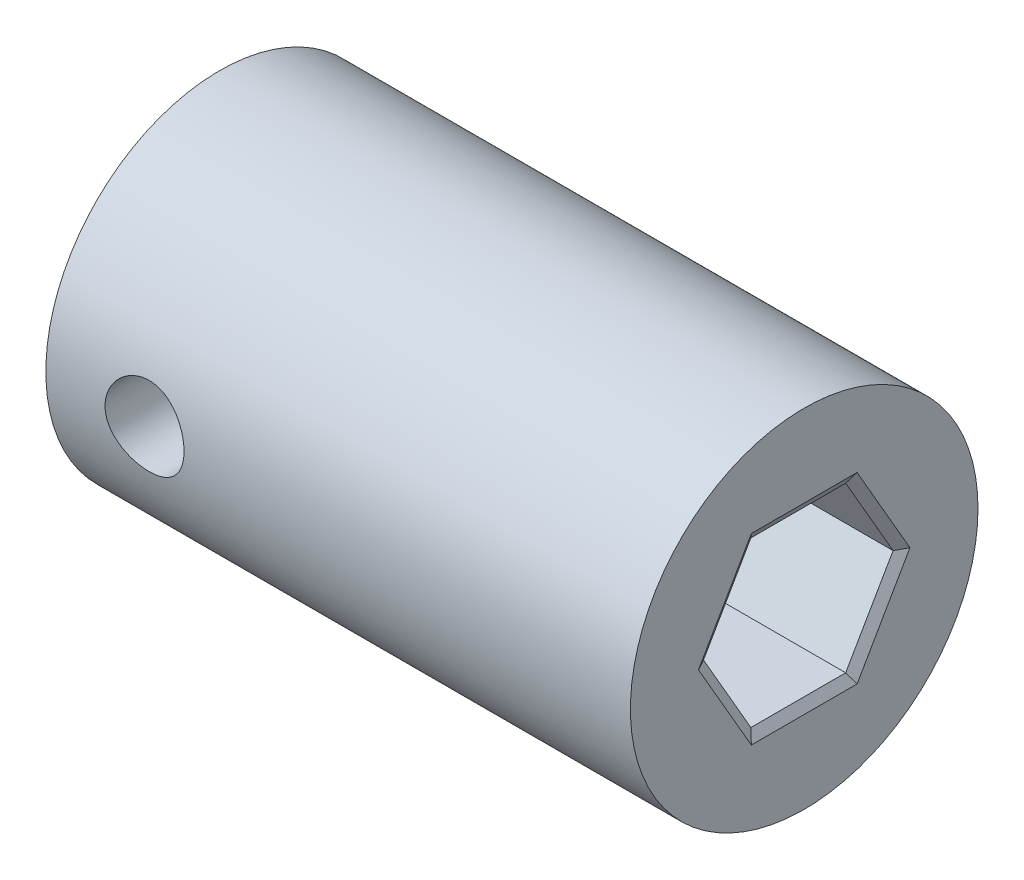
ISO-10303-21;
HEADER;
FILE_DESCRIPTION(('STEP AP214'),'2;1');
FILE_NAME('part.step','',(''),(''),'','','');
FILE_SCHEMA(('AUTOMOTIVE_DESIGN { 1 0 10303 214 1 1 1 1 }'));
ENDSEC;
DATA;
#1=APPLICATION_CONTEXT('core data for automotive mechanical design processes');
#2=APPLICATION_PROTOCOL_DEFINITION('international standard','automotive_design',2000,#1);
#3=PRODUCT_CONTEXT('',#1,'mechanical');
#4=PRODUCT('Part','Part','',(#3));
#5=PRODUCT_RELATED_PRODUCT_CATEGORY('part','',(#4));
#6=PRODUCT_DEFINITION_FORMATION('','',#4);
#7=PRODUCT_DEFINITION_CONTEXT('part definition',#1,'design');
#8=PRODUCT_DEFINITION('design','',#6,#7);
#9=PRODUCT_DEFINITION_SHAPE('','',#8);
#10=(LENGTH_UNIT() NAMED_UNIT(*) SI_UNIT(.MILLI.,.METRE.));
#11=(NAMED_UNIT(*) PLANE_ANGLE_UNIT() SI_UNIT($,.RADIAN.));
#12=(NAMED_UNIT(*) SI_UNIT($,.STERADIAN.) SOLID_ANGLE_UNIT());
#13=UNCERTAINTY_MEASURE_WITH_UNIT(LENGTH_MEASURE(1.E-05),#10,'distance_accuracy_value','');
#14=(GEOMETRIC_REPRESENTATION_CONTEXT(3) GLOBAL_UNCERTAINTY_ASSIGNED_CONTEXT((#13)) GLOBAL_UNIT_ASSIGNED_CONTEXT((#10,
#11,#12)) REPRESENTATION_CONTEXT('',''));
#15=CARTESIAN_POINT('',(0.,0.,0.));
#16=DIRECTION('',(0.,0.,1.));
#17=DIRECTION('',(1.,0.,0.));
#18=AXIS2_PLACEMENT_3D('',#15,#16,#17);
#19=CARTESIAN_POINT('',(37.,0.,0.));
#20=DIRECTION('',(1.,0.,0.));
#21=DIRECTION('',(0.,0.,-1.));
#22=AXIS2_PLACEMENT_3D('',#19,#20,#21);
#23=PLANE('',#22);
#24=DIRECTION('',(0.,0.866025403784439,0.5));
#25=VECTOR('',#24,1.);
#26=CARTESIAN_POINT('',(37.,-2.8980762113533,5.01961524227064));
#27=LINE('',#26,#25);
#28=CARTESIAN_POINT('',(37.,-5.79615242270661,3.34641016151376));
#29=VERTEX_POINT('',#28);
#30=CARTESIAN_POINT('',(37.,0.,6.69282032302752));
#31=VERTEX_POINT('',#30);
#32=EDGE_CURVE('E192',#29,#31,#27,.T.);
#33=ORIENTED_EDGE('',*,*,#32,.T.);
#34=DIRECTION('',(0.,0.866025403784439,-0.5));
#35=VECTOR('',#34,1.);
#36=CARTESIAN_POINT('',(37.,2.8980762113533,5.01961524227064));
#37=LINE('',#36,#35);
#38=CARTESIAN_POINT('',(37.,5.79615242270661,3.34641016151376));
#39=VERTEX_POINT('',#38);
#40=EDGE_CURVE('E194',#31,#39,#37,.T.);
#41=ORIENTED_EDGE('',*,*,#40,.T.);
#42=DIRECTION('',(0.,0.,-1.));
#43=VECTOR('',#42,1.);
#44=CARTESIAN_POINT('',(37.,5.79615242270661,0.));
#45=LINE('',#44,#43);
#46=CARTESIAN_POINT('',(37.,5.79615242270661,-3.34641016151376));
#47=VERTEX_POINT('',#46);
#48=EDGE_CURVE('E184',#39,#47,#45,.T.);
#49=ORIENTED_EDGE('',*,*,#48,.T.);
#50=DIRECTION('',(0.,-0.866025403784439,-0.5));
#51=VECTOR('',#50,1.);
#52=CARTESIAN_POINT('',(37.,2.8980762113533,-5.01961524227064));
#53=LINE('',#52,#51);
#54=CARTESIAN_POINT('',(37.,0.,-6.69282032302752));
#55=VERTEX_POINT('',#54);
#56=EDGE_CURVE('E186',#47,#55,#53,.T.);
#57=ORIENTED_EDGE('',*,*,#56,.T.);
#58=DIRECTION('',(0.,-0.866025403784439,0.5));
#59=VECTOR('',#58,1.);
#60=CARTESIAN_POINT('',(37.,-2.8980762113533,-5.01961524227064));
#61=LINE('',#60,#59);
#62=CARTESIAN_POINT('',(37.,-5.79615242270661,-3.34641016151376));
#63=VERTEX_POINT('',#62);
#64=EDGE_CURVE('E188',#55,#63,#61,.T.);
#65=ORIENTED_EDGE('',*,*,#64,.T.);
#66=DIRECTION('',(0.,0.,1.));
#67=VECTOR('',#66,1.);
#68=CARTESIAN_POINT('',(37.,-5.79615242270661,0.));
#69=LINE('',#68,#67);
#70=EDGE_CURVE('E190',#63,#29,#69,.T.);
#71=ORIENTED_EDGE('',*,*,#70,.T.);
#72=EDGE_LOOP('',(#33,#41,#49,#57,#65,#71));
#73=FACE_BOUND('',#72,.T.);
#74=CARTESIAN_POINT('',(37.,0.,0.));
#75=DIRECTION('',(1.,0.,0.));
#76=DIRECTION('',(0.,0.,-1.));
#77=AXIS2_PLACEMENT_3D('',#74,#75,#76);
#78=CIRCLE('',#77,11.);
#79=CARTESIAN_POINT('',(37.,0.,-11.));
#80=VERTEX_POINT('',#79);
#81=EDGE_CURVE('E167',#80,#80,#78,.T.);
#82=ORIENTED_EDGE('',*,*,#81,.T.);
#83=EDGE_LOOP('',(#82));
#84=FACE_BOUND('',#83,.T.);
#85=ADVANCED_FACE('F43',(#73,#84),#23,.T.);
#86=CARTESIAN_POINT('',(37.,0.,0.));
#87=DIRECTION('',(-1.,0.,0.));
#88=DIRECTION('',(0.,0.,1.));
#89=AXIS2_PLACEMENT_3D('',#86,#87,#88);
#90=CYLINDRICAL_SURFACE('',#89,3.9);
#91=CARTESIAN_POINT('',(8.74464655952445,0.,3.9));
#92=CARTESIAN_POINT('',(8.74463580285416,-0.126441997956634,3.89999010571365));
#93=CARTESIAN_POINT('',(8.7349890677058,-0.253016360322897,3.89378751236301));
#94=CARTESIAN_POINT('',(8.69693370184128,-0.502240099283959,3.86956150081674));
#95=CARTESIAN_POINT('',(8.6684942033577,-0.624882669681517,3.85151863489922));
#96=CARTESIAN_POINT('',(8.59454817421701,-0.862167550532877,3.80541821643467));
#97=CARTESIAN_POINT('',(8.54912653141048,-0.976846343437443,3.77741050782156));
#98=CARTESIAN_POINT('',(8.44310441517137,-1.19652682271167,3.71368080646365));
#99=CARTESIAN_POINT('',(8.3825047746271,-1.30152903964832,3.67795923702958));
#100=CARTESIAN_POINT('',(8.2423977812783,-1.50860126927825,3.59825154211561));
#101=CARTESIAN_POINT('',(8.16174836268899,-1.60972681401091,3.55382815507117));
#102=CARTESIAN_POINT('',(7.98649260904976,-1.79792643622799,3.46243148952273));
#103=CARTESIAN_POINT('',(7.89186692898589,-1.88498068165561,3.41545473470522));
#104=CARTESIAN_POINT('',(7.67544838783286,-2.05533987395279,3.31611586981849));
#105=CARTESIAN_POINT('',(7.55170560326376,-2.13630262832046,3.26395156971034));
#106=CARTESIAN_POINT('',(7.28934596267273,-2.27609269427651,3.16805958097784));
#107=CARTESIAN_POINT('',(7.15075517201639,-2.33495800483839,3.12431747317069));
#108=CARTESIAN_POINT('',(6.90063512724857,-2.41494132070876,3.06266033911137));
#109=CARTESIAN_POINT('',(6.79193474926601,-2.4419638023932,3.04095933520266));
#110=CARTESIAN_POINT('',(6.57032144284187,-2.48123999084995,3.00900466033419));
#111=CARTESIAN_POINT('',(6.45741522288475,-2.4935162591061,2.99873350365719));
#112=CARTESIAN_POINT('',(6.2301759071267,-2.50254999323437,2.99120155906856));
#113=CARTESIAN_POINT('',(6.11583945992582,-2.49925895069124,2.99398143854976));
#114=CARTESIAN_POINT('',(5.8896490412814,-2.47727931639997,3.01218762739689));
#115=CARTESIAN_POINT('',(5.77779720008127,-2.45857799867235,3.02762438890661));
#116=CARTESIAN_POINT('',(5.56285045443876,-2.40769612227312,3.0682249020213));
#117=CARTESIAN_POINT('',(5.45959292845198,-2.37594098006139,3.09307988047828));
#118=CARTESIAN_POINT('',(5.25970436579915,-2.30028771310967,3.14974682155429));
#119=CARTESIAN_POINT('',(5.16307554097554,-2.25638555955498,3.18156109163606));
#120=CARTESIAN_POINT('',(4.95926462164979,-2.14792495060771,3.25599897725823));
#121=CARTESIAN_POINT('',(4.85366566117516,-2.08101231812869,3.29952259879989));
#122=CARTESIAN_POINT('',(4.65399409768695,-1.93269700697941,3.38853672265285));
#123=CARTESIAN_POINT('',(4.55993540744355,-1.85127712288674,3.43402951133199));
#124=CARTESIAN_POINT('',(4.36837774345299,-1.65870029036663,3.53162798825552));
#125=CARTESIAN_POINT('',(4.27341600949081,-1.54482818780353,3.58341485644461));
#126=CARTESIAN_POINT('',(4.10400149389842,-1.29990010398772,3.67933400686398));
#127=CARTESIAN_POINT('',(4.02952688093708,-1.16886263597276,3.72347441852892));
#128=CARTESIAN_POINT('',(3.91686702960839,-0.919909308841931,3.79169883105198));
#129=CARTESIAN_POINT('',(3.87441510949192,-0.804538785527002,3.81802393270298));
#130=CARTESIAN_POINT('',(3.80668942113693,-0.567074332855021,3.86043147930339));
#131=CARTESIAN_POINT('',(3.78140181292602,-0.444985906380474,3.87652217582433));
#132=CARTESIAN_POINT('',(3.74927531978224,-0.196985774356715,3.8970145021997));
#133=CARTESIAN_POINT('',(3.74249893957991,-0.0710625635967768,3.90137652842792));
#134=CARTESIAN_POINT('',(3.74798547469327,0.180202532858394,3.89785987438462));
#135=CARTESIAN_POINT('',(3.76024942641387,0.305544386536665,3.88998052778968));
#136=CARTESIAN_POINT('',(3.80192612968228,0.545076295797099,3.86350165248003));
#137=CARTESIAN_POINT('',(3.83038123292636,0.659503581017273,3.84550139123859));
#138=CARTESIAN_POINT('',(3.90235760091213,0.881661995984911,3.80072700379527));
#139=CARTESIAN_POINT('',(3.94588139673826,0.989391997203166,3.77395140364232));
#140=CARTESIAN_POINT('',(4.05012648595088,1.20388427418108,3.71134103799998));
#141=CARTESIAN_POINT('',(4.1118795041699,1.30998901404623,3.67498372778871));
#142=CARTESIAN_POINT('',(4.24910176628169,1.5108337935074,3.59708329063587));
#143=CARTESIAN_POINT('',(4.32458156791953,1.60556499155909,3.55553617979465));
#144=CARTESIAN_POINT('',(4.50024746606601,1.79620589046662,3.46359320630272));
#145=CARTESIAN_POINT('',(4.60244662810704,1.89007990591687,3.41281584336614));
#146=CARTESIAN_POINT('',(4.82150923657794,2.06007294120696,3.31297723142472));
#147=CARTESIAN_POINT('',(4.93837581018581,2.13618816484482,3.26391635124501));
#148=CARTESIAN_POINT('',(5.16872118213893,2.25988927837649,3.1792675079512));
#149=CARTESIAN_POINT('',(5.28053349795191,2.30993770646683,3.14275488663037));
#150=CARTESIAN_POINT('',(5.51280286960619,2.39364931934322,3.07948498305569));
#151=CARTESIAN_POINT('',(5.63324770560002,2.42733516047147,3.05271422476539));
#152=CARTESIAN_POINT('',(5.81884703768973,2.46429517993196,3.02282850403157));
#153=CARTESIAN_POINT('',(5.88188967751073,2.47437069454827,3.01456203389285));
#154=CARTESIAN_POINT('',(6.00893400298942,2.48968352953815,3.00192910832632));
#155=CARTESIAN_POINT('',(6.07293517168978,2.49492336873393,2.99756062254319));
#156=CARTESIAN_POINT('',(6.20127642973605,2.50044848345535,2.9929535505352));
#157=CARTESIAN_POINT('',(6.26561637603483,2.5007357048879,2.99271334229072));
#158=CARTESIAN_POINT('',(6.39398994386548,2.49636279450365,2.99636059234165));
#159=CARTESIAN_POINT('',(6.45802359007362,2.49170306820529,3.00024771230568));
#160=CARTESIAN_POINT('',(6.63016363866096,2.47250323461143,3.01612313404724));
#161=CARTESIAN_POINT('',(6.73744683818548,2.45330859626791,3.03189462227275));
#162=CARTESIAN_POINT('',(6.94688268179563,2.40178029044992,3.07286678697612));
#163=CARTESIAN_POINT('',(7.04903008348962,2.36943349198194,3.09807688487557));
#164=CARTESIAN_POINT('',(7.28084212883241,2.2796094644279,3.16504234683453));
#165=CARTESIAN_POINT('',(7.40785967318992,2.21731346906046,3.20950553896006));
#166=CARTESIAN_POINT('',(7.64819507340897,2.07357628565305,3.30419272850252));
#167=CARTESIAN_POINT('',(7.76149408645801,1.99210920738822,3.35442446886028));
#168=CARTESIAN_POINT('',(7.97425542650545,1.8105903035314,3.45582357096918));
#169=CARTESIAN_POINT('',(8.07353603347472,1.71032783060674,3.50699493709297));
#170=CARTESIAN_POINT('',(8.25478469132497,1.49308707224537,3.60483555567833));
#171=CARTESIAN_POINT('',(8.33675228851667,1.37610834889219,3.65150469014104));
#172=CARTESIAN_POINT('',(8.4458090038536,1.1876055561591,3.71540339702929));
#173=CARTESIAN_POINT('',(8.48029101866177,1.12139245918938,3.73597050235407));
#174=CARTESIAN_POINT('',(8.54345201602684,0.985444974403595,3.77410513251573));
#175=CARTESIAN_POINT('',(8.57213430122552,0.915712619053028,3.79167436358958));
#176=CARTESIAN_POINT('',(8.62320999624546,0.77339434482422,3.82323979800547));
#177=CARTESIAN_POINT('',(8.64561838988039,0.700815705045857,3.83724450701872));
#178=CARTESIAN_POINT('',(8.68382929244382,0.553338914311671,3.86126808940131));
#179=CARTESIAN_POINT('',(8.69963639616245,0.478442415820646,3.87128973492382));
#180=CARTESIAN_POINT('',(8.72281466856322,0.336446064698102,3.88603234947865));
#181=CARTESIAN_POINT('',(8.73098796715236,0.269528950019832,3.89125596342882));
#182=CARTESIAN_POINT('',(8.74190684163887,0.135087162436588,3.89824246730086));
#183=CARTESIAN_POINT('',(8.74465230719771,0.0675624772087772,3.90000528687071));
#184=CARTESIAN_POINT('',(8.74464655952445,0.,3.9));
#185=B_SPLINE_CURVE_WITH_KNOTS('',3,(#91,#92,#93,#94,#95,#96,#97,#98,#99,#100,#101,#102,#103,
#104,#105,#106,#107,#108,#109,#110,#111,#112,#113,#114,#115,#116,#117,#118,#119,#120,#121,#122,
#123,#124,#125,#126,#127,#128,#129,#130,#131,#132,#133,#134,#135,#136,#137,#138,#139,#140,#141,
#142,#143,#144,#145,#146,#147,#148,#149,#150,#151,#152,#153,#154,#155,#156,#157,#158,#159,#160,
#161,#162,#163,#164,#165,#166,#167,#168,#169,#170,#171,#172,#173,#174,#175,#176,#177,#178,#179,
#180,#181,#182,#183,#184),.UNSPECIFIED.,.T.,.F.,(4,2,2,2,2,2,2,2,2,2,2,2,2,2,2,2,2,2,2,2,2,2,2,
2,2,2,2,2,2,2,2,2,2,2,2,2,2,2,2,2,2,2,2,2,2,2,4),(0.,0.379055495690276,0.758735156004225,
1.13654176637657,1.51432764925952,1.92305431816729,2.33235211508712,2.80054811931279,
3.26793528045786,3.60881330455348,3.94916912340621,4.29058620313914,4.63228551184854,
4.96363540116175,5.29509532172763,5.69078145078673,6.0869400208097,6.55581107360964,
7.02418053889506,7.39973772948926,7.77499173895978,8.15151126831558,8.52805129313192,
8.88434272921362,9.24069404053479,9.62333082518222,10.0062631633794,10.447762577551,
10.8893562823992,11.2714299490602,11.6529730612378,11.8458399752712,12.0386063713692,
12.2312970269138,12.4239718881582,12.752766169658,13.0818895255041,13.5244258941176,
13.9675633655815,14.4160014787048,14.864451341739,15.0964612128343,15.3283385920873,
15.5596573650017,15.7908148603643,15.9933536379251,16.1958965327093),.UNSPECIFIED.);
#186=CARTESIAN_POINT('',(8.74464655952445,0.,3.9));
#187=VERTEX_POINT('',#186);
#188=EDGE_CURVE('E145',#187,#187,#185,.T.);
#189=ORIENTED_EDGE('',*,*,#188,.F.);
#190=EDGE_LOOP('',(#189));
#191=FACE_BOUND('',#190,.T.);
#192=CARTESIAN_POINT('',(8.74464655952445,0.,-3.9));
#193=CARTESIAN_POINT('',(8.74463580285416,0.126441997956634,-3.89999010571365));
#194=CARTESIAN_POINT('',(8.7349890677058,0.253016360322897,-3.89378751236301));
#195=CARTESIAN_POINT('',(8.69693370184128,0.502240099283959,-3.86956150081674));
#196=CARTESIAN_POINT('',(8.6684942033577,0.624882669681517,-3.85151863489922));
#197=CARTESIAN_POINT('',(8.59454817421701,0.862167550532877,-3.80541821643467));
#198=CARTESIAN_POINT('',(8.54912653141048,0.976846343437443,-3.77741050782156));
#199=CARTESIAN_POINT('',(8.44310441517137,1.19652682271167,-3.71368080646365));
#200=CARTESIAN_POINT('',(8.3825047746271,1.30152903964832,-3.67795923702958));
#201=CARTESIAN_POINT('',(8.2423977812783,1.50860126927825,-3.59825154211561));
#202=CARTESIAN_POINT('',(8.16174836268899,1.60972681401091,-3.55382815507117));
#203=CARTESIAN_POINT('',(7.98649260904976,1.79792643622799,-3.46243148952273));
#204=CARTESIAN_POINT('',(7.89186692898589,1.88498068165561,-3.41545473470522));
#205=CARTESIAN_POINT('',(7.67544838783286,2.05533987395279,-3.31611586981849));
#206=CARTESIAN_POINT('',(7.55170560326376,2.13630262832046,-3.26395156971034));
#207=CARTESIAN_POINT('',(7.28934596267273,2.27609269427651,-3.16805958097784));
#208=CARTESIAN_POINT('',(7.15075517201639,2.33495800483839,-3.12431747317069));
#209=CARTESIAN_POINT('',(6.90063512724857,2.41494132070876,-3.06266033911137));
#210=CARTESIAN_POINT('',(6.79193474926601,2.4419638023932,-3.04095933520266));
#211=CARTESIAN_POINT('',(6.57032144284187,2.48123999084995,-3.00900466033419));
#212=CARTESIAN_POINT('',(6.45741522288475,2.4935162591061,-2.99873350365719));
#213=CARTESIAN_POINT('',(6.2301759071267,2.50254999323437,-2.99120155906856));
#214=CARTESIAN_POINT('',(6.11583945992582,2.49925895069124,-2.99398143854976));
#215=CARTESIAN_POINT('',(5.8896490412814,2.47727931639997,-3.01218762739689));
#216=CARTESIAN_POINT('',(5.77779720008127,2.45857799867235,-3.02762438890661));
#217=CARTESIAN_POINT('',(5.56285045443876,2.40769612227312,-3.0682249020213));
#218=CARTESIAN_POINT('',(5.45959292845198,2.37594098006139,-3.09307988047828));
#219=CARTESIAN_POINT('',(5.25970436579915,2.30028771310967,-3.14974682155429));
#220=CARTESIAN_POINT('',(5.16307554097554,2.25638555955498,-3.18156109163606));
#221=CARTESIAN_POINT('',(4.95926462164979,2.14792495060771,-3.25599897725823));
#222=CARTESIAN_POINT('',(4.85366566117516,2.08101231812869,-3.29952259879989));
#223=CARTESIAN_POINT('',(4.65399409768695,1.93269700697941,-3.38853672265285));
#224=CARTESIAN_POINT('',(4.55993540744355,1.85127712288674,-3.43402951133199));
#225=CARTESIAN_POINT('',(4.36837774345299,1.65870029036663,-3.53162798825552));
#226=CARTESIAN_POINT('',(4.27341600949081,1.54482818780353,-3.58341485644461));
#227=CARTESIAN_POINT('',(4.10400149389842,1.29990010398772,-3.67933400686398));
#228=CARTESIAN_POINT('',(4.02952688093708,1.16886263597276,-3.72347441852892));
#229=CARTESIAN_POINT('',(3.91686702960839,0.919909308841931,-3.79169883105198));
#230=CARTESIAN_POINT('',(3.87441510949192,0.804538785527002,-3.81802393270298));
#231=CARTESIAN_POINT('',(3.80668942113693,0.567074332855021,-3.86043147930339));
#232=CARTESIAN_POINT('',(3.78140181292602,0.444985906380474,-3.87652217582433));
#233=CARTESIAN_POINT('',(3.74927531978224,0.196985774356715,-3.8970145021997));
#234=CARTESIAN_POINT('',(3.74249893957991,0.0710625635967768,-3.90137652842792));
#235=CARTESIAN_POINT('',(3.74798547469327,-0.180202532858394,-3.89785987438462));
#236=CARTESIAN_POINT('',(3.76024942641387,-0.305544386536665,-3.88998052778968));
#237=CARTESIAN_POINT('',(3.80192612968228,-0.545076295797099,-3.86350165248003));
#238=CARTESIAN_POINT('',(3.83038123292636,-0.659503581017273,-3.84550139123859));
#239=CARTESIAN_POINT('',(3.90235760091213,-0.881661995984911,-3.80072700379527));
#240=CARTESIAN_POINT('',(3.94588139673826,-0.989391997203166,-3.77395140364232));
#241=CARTESIAN_POINT('',(4.05012648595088,-1.20388427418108,-3.71134103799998));
#242=CARTESIAN_POINT('',(4.1118795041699,-1.30998901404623,-3.67498372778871));
#243=CARTESIAN_POINT('',(4.24910176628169,-1.5108337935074,-3.59708329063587));
#244=CARTESIAN_POINT('',(4.32458156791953,-1.60556499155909,-3.55553617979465));
#245=CARTESIAN_POINT('',(4.50024746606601,-1.79620589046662,-3.46359320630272));
#246=CARTESIAN_POINT('',(4.60244662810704,-1.89007990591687,-3.41281584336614));
#247=CARTESIAN_POINT('',(4.82150923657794,-2.06007294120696,-3.31297723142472));
#248=CARTESIAN_POINT('',(4.93837581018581,-2.13618816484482,-3.26391635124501));
#249=CARTESIAN_POINT('',(5.16872118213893,-2.25988927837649,-3.1792675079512));
#250=CARTESIAN_POINT('',(5.28053349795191,-2.30993770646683,-3.14275488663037));
#251=CARTESIAN_POINT('',(5.51280286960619,-2.39364931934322,-3.07948498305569));
#252=CARTESIAN_POINT('',(5.63324770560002,-2.42733516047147,-3.05271422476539));
#253=CARTESIAN_POINT('',(5.81884703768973,-2.46429517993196,-3.02282850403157));
#254=CARTESIAN_POINT('',(5.88188967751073,-2.47437069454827,-3.01456203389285));
#255=CARTESIAN_POINT('',(6.00893400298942,-2.48968352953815,-3.00192910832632));
#256=CARTESIAN_POINT('',(6.07293517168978,-2.49492336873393,-2.99756062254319));
#257=CARTESIAN_POINT('',(6.20127642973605,-2.50044848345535,-2.9929535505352));
#258=CARTESIAN_POINT('',(6.26561637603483,-2.5007357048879,-2.99271334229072));
#259=CARTESIAN_POINT('',(6.39398994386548,-2.49636279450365,-2.99636059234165));
#260=CARTESIAN_POINT('',(6.45802359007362,-2.49170306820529,-3.00024771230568));
#261=CARTESIAN_POINT('',(6.63016363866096,-2.47250323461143,-3.01612313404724));
#262=CARTESIAN_POINT('',(6.73744683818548,-2.45330859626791,-3.03189462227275));
#263=CARTESIAN_POINT('',(6.94688268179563,-2.40178029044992,-3.07286678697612));
#264=CARTESIAN_POINT('',(7.04903008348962,-2.36943349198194,-3.09807688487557));
#265=CARTESIAN_POINT('',(7.28084212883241,-2.2796094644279,-3.16504234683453));
#266=CARTESIAN_POINT('',(7.40785967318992,-2.21731346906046,-3.20950553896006));
#267=CARTESIAN_POINT('',(7.64819507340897,-2.07357628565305,-3.30419272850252));
#268=CARTESIAN_POINT('',(7.76149408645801,-1.99210920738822,-3.35442446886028));
#269=CARTESIAN_POINT('',(7.97425542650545,-1.8105903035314,-3.45582357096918));
#270=CARTESIAN_POINT('',(8.07353603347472,-1.71032783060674,-3.50699493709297));
#271=CARTESIAN_POINT('',(8.25478469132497,-1.49308707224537,-3.60483555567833));
#272=CARTESIAN_POINT('',(8.33675228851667,-1.37610834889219,-3.65150469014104));
#273=CARTESIAN_POINT('',(8.4458090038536,-1.1876055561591,-3.71540339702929));
#274=CARTESIAN_POINT('',(8.48029101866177,-1.12139245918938,-3.73597050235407));
#275=CARTESIAN_POINT('',(8.54345201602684,-0.985444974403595,-3.77410513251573));
#276=CARTESIAN_POINT('',(8.57213430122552,-0.915712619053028,-3.79167436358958));
#277=CARTESIAN_POINT('',(8.62320999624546,-0.77339434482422,-3.82323979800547));
#278=CARTESIAN_POINT('',(8.64561838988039,-0.700815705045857,-3.83724450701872));
#279=CARTESIAN_POINT('',(8.68382929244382,-0.553338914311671,-3.86126808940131));
#280=CARTESIAN_POINT('',(8.69963639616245,-0.478442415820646,-3.87128973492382));
#281=CARTESIAN_POINT('',(8.72281466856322,-0.336446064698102,-3.88603234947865));
#282=CARTESIAN_POINT('',(8.73098796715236,-0.269528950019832,-3.89125596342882));
#283=CARTESIAN_POINT('',(8.74190684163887,-0.135087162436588,-3.89824246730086));
#284=CARTESIAN_POINT('',(8.74465230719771,-0.0675624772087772,-3.90000528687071));
#285=CARTESIAN_POINT('',(8.74464655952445,0.,-3.9));
#286=B_SPLINE_CURVE_WITH_KNOTS('',3,(#192,#193,#194,#195,#196,#197,#198,#199,#200,#201,#202,
#203,#204,#205,#206,#207,#208,#209,#210,#211,#212,#213,#214,#215,#216,#217,#218,#219,#220,#221,
#222,#223,#224,#225,#226,#227,#228,#229,#230,#231,#232,#233,#234,#235,#236,#237,#238,#239,#240,
#241,#242,#243,#244,#245,#246,#247,#248,#249,#250,#251,#252,#253,#254,#255,#256,#257,#258,#259,
#260,#261,#262,#263,#264,#265,#266,#267,#268,#269,#270,#271,#272,#273,#274,#275,#276,#277,#278,
#279,#280,#281,#282,#283,#284,#285),.UNSPECIFIED.,.T.,.F.,(4,2,2,2,2,2,2,2,2,2,2,2,2,2,2,2,2,2,
2,2,2,2,2,2,2,2,2,2,2,2,2,2,2,2,2,2,2,2,2,2,2,2,2,2,2,2,4),(0.,0.379055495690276,
0.758735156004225,1.13654176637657,1.51432764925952,1.92305431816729,2.33235211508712,
2.80054811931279,3.26793528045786,3.60881330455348,3.94916912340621,4.29058620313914,
4.63228551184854,4.96363540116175,5.29509532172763,5.69078145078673,6.0869400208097,
6.55581107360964,7.02418053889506,7.39973772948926,7.77499173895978,8.15151126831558,
8.52805129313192,8.88434272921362,9.24069404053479,9.62333082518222,10.0062631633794,
10.447762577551,10.8893562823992,11.2714299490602,11.6529730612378,11.8458399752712,
12.0386063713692,12.2312970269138,12.4239718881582,12.752766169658,13.0818895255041,
13.5244258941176,13.9675633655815,14.4160014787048,14.864451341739,15.0964612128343,
15.3283385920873,15.5596573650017,15.7908148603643,15.9933536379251,16.1958965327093),.UNSPECIFIED.);
#287=CARTESIAN_POINT('',(8.74464655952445,0.,-3.9));
#288=VERTEX_POINT('',#287);
#289=EDGE_CURVE('E233',#288,#288,#286,.T.);
#290=ORIENTED_EDGE('',*,*,#289,.F.);
#291=EDGE_LOOP('',(#290));
#292=FACE_BOUND('',#291,.T.);
#293=CARTESIAN_POINT('',(1.2,0.,0.));
#294=DIRECTION('',(1.,0.,0.));
#295=DIRECTION('',(0.,0.,-1.));
#296=AXIS2_PLACEMENT_3D('',#293,#294,#295);
#297=CIRCLE('',#296,3.9);
#298=CARTESIAN_POINT('',(1.2,0.,-3.9));
#299=VERTEX_POINT('',#298);
#300=EDGE_CURVE('E176',#299,#299,#297,.F.);
#301=ORIENTED_EDGE('',*,*,#300,.T.);
#302=EDGE_LOOP('',(#301));
#303=FACE_BOUND('',#302,.T.);
#304=CARTESIAN_POINT('',(20.,0.,0.));
#305=DIRECTION('',(1.,0.,0.));
#306=DIRECTION('',(0.,0.,-1.));
#307=AXIS2_PLACEMENT_3D('',#304,#305,#306);
#308=CIRCLE('',#307,3.9);
#309=CARTESIAN_POINT('',(20.,0.,-3.9));
#310=VERTEX_POINT('',#309);
#311=EDGE_CURVE('E123',#310,#310,#308,.T.);
#312=ORIENTED_EDGE('',*,*,#311,.T.);
#313=EDGE_LOOP('',(#312));
#314=FACE_BOUND('',#313,.T.);
#315=ADVANCED_FACE('F237',(#191,#292,#303,#314),#90,.F.);
#316=CARTESIAN_POINT('',(0.,0.,0.));
#317=DIRECTION('',(1.,0.,0.));
#318=DIRECTION('',(0.,0.,-1.));
#319=AXIS2_PLACEMENT_3D('',#316,#317,#318);
#320=PLANE('',#319);
#321=CARTESIAN_POINT('',(0.,0.,0.));
#322=DIRECTION('',(1.,0.,0.));
#323=DIRECTION('',(0.,0.,-1.));
#324=AXIS2_PLACEMENT_3D('',#321,#322,#323);
#325=CIRCLE('',#324,4.64984322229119);
#326=CARTESIAN_POINT('',(0.,0.,-4.64984322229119));
#327=VERTEX_POINT('',#326);
#328=EDGE_CURVE('E170',#327,#327,#325,.T.);
#329=ORIENTED_EDGE('',*,*,#328,.T.);
#330=EDGE_LOOP('',(#329));
#331=FACE_BOUND('',#330,.T.);
#332=CARTESIAN_POINT('',(0.,0.,0.));
#333=DIRECTION('',(1.,0.,0.));
#334=DIRECTION('',(0.,0.,-1.));
#335=AXIS2_PLACEMENT_3D('',#332,#333,#334);
#336=CIRCLE('',#335,11.);
#337=CARTESIAN_POINT('',(0.,0.,-11.));
#338=VERTEX_POINT('',#337);
#339=EDGE_CURVE('E171',#338,#338,#336,.T.);
#340=ORIENTED_EDGE('',*,*,#339,.F.);
#341=EDGE_LOOP('',(#340));
#342=FACE_BOUND('',#341,.T.);
#343=ADVANCED_FACE('F242',(#331,#342),#320,.F.);
#344=CARTESIAN_POINT('',(37.,0.,0.));
#345=DIRECTION('',(-1.,0.,0.));
#346=DIRECTION('',(0.,0.,1.));
#347=AXIS2_PLACEMENT_3D('',#344,#345,#346);
#348=CYLINDRICAL_SURFACE('',#347,11.);
#349=CARTESIAN_POINT('',(8.74464655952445,0.,-11.));
#350=CARTESIAN_POINT('',(8.74464202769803,0.138518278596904,-10.9999974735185));
#351=CARTESIAN_POINT('',(8.73309533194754,0.277090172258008,-10.9973570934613));
#352=CARTESIAN_POINT('',(8.68726708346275,0.550288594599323,-10.987079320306));
#353=CARTESIAN_POINT('',(8.65297016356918,0.684912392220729,-10.9794385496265));
#354=CARTESIAN_POINT('',(8.56277851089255,0.946227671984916,-10.9600095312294));
#355=CARTESIAN_POINT('',(8.50690723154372,1.07292759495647,-10.9482257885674));
#356=CARTESIAN_POINT('',(8.37522944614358,1.31515227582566,-10.921778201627));
#357=CARTESIAN_POINT('',(8.29942313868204,1.43067714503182,-10.9071143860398));
#358=CARTESIAN_POINT('',(8.12864451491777,1.64926760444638,-10.8762265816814));
#359=CARTESIAN_POINT('',(8.03339398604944,1.75211293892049,-10.8599819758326));
#360=CARTESIAN_POINT('',(7.8270275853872,1.9405138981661,-10.827906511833));
#361=CARTESIAN_POINT('',(7.71591020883,2.02606788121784,-10.8120756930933));
#362=CARTESIAN_POINT('',(7.47931450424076,2.17844599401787,-10.7824158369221));
#363=CARTESIAN_POINT('',(7.35367956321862,2.24503254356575,-10.7686131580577));
#364=CARTESIAN_POINT('',(7.09263705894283,2.3560606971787,-10.7448696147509));
#365=CARTESIAN_POINT('',(6.95723076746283,2.40050517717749,-10.7349282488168));
#366=CARTESIAN_POINT('',(6.68288737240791,2.46525349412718,-10.7202434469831));
#367=CARTESIAN_POINT('',(6.5440472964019,2.48594892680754,-10.715415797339));
#368=CARTESIAN_POINT('',(6.26478833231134,2.50382988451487,-10.7112523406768));
#369=CARTESIAN_POINT('',(6.12436965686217,2.50101853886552,-10.711915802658));
#370=CARTESIAN_POINT('',(5.84887367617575,2.47228016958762,-10.7185835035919));
#371=CARTESIAN_POINT('',(5.71374565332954,2.44681104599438,-10.7244819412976));
#372=CARTESIAN_POINT('',(5.44973207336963,2.37420684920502,-10.7407873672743));
#373=CARTESIAN_POINT('',(5.32084689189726,2.32707047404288,-10.7511946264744));
#374=CARTESIAN_POINT('',(5.07170588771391,2.21205734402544,-10.7754474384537));
#375=CARTESIAN_POINT('',(4.95153304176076,2.14400712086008,-10.7893215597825));
#376=CARTESIAN_POINT('',(4.72414400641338,1.98921977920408,-10.8189276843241));
#377=CARTESIAN_POINT('',(4.61692971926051,1.90247992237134,-10.8346599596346));
#378=CARTESIAN_POINT('',(4.41586799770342,1.71036518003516,-10.8666615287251));
#379=CARTESIAN_POINT('',(4.32239213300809,1.60460166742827,-10.882934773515));
#380=CARTESIAN_POINT('',(4.15444067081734,1.37871229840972,-10.9138502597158));
#381=CARTESIAN_POINT('',(4.07996547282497,1.2585861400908,-10.9284924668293));
#382=CARTESIAN_POINT('',(3.95202617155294,1.00690799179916,-10.9545497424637));
#383=CARTESIAN_POINT('',(3.89861378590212,0.875328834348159,-10.9659568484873));
#384=CARTESIAN_POINT('',(3.81476255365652,0.604745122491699,-10.9841998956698));
#385=CARTESIAN_POINT('',(3.78432009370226,0.465741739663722,-10.9910365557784));
#386=CARTESIAN_POINT('',(3.74782032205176,0.187439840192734,-10.9992650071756));
#387=CARTESIAN_POINT('',(3.74125586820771,0.0482110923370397,-11.0007700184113));
#388=CARTESIAN_POINT('',(3.75131959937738,-0.229353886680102,-10.9984842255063));
#389=CARTESIAN_POINT('',(3.76794607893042,-0.367690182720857,-10.9946938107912));
#390=CARTESIAN_POINT('',(3.82349972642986,-0.637841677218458,-10.9823148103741));
#391=CARTESIAN_POINT('',(3.86215810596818,-0.769715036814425,-10.973784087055));
#392=CARTESIAN_POINT('',(3.96037758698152,-1.0251039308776,-10.9528806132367));
#393=CARTESIAN_POINT('',(4.01994056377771,-1.14861871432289,-10.9405075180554));
#394=CARTESIAN_POINT('',(4.15931570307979,-1.38586085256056,-10.9130143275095));
#395=CARTESIAN_POINT('',(4.23942218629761,-1.49941068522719,-10.8978552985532));
#396=CARTESIAN_POINT('',(4.41722588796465,-1.71163773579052,-10.866546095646));
#397=CARTESIAN_POINT('',(4.51492558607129,-1.8103128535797,-10.8503957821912));
#398=CARTESIAN_POINT('',(4.72747752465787,-1.99201706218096,-10.8185287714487));
#399=CARTESIAN_POINT('',(4.84263380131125,-2.07469366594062,-10.8028272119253));
#400=CARTESIAN_POINT('',(5.08549295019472,-2.21953814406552,-10.7740023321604));
#401=CARTESIAN_POINT('',(5.21319526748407,-2.28170692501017,-10.7608788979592));
#402=CARTESIAN_POINT('',(5.47682702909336,-2.38333597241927,-10.7388274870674));
#403=CARTESIAN_POINT('',(5.61270388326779,-2.42292716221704,-10.7298753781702));
#404=CARTESIAN_POINT('',(5.88941346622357,-2.47865258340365,-10.7171411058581));
#405=CARTESIAN_POINT('',(6.03024532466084,-2.49479091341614,-10.7133580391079));
#406=CARTESIAN_POINT('',(6.30930517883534,-2.50296739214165,-10.7114502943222));
#407=CARTESIAN_POINT('',(6.44751615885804,-2.4955654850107,-10.7131941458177));
#408=CARTESIAN_POINT('',(6.7206654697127,-2.45813115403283,-10.7218446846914));
#409=CARTESIAN_POINT('',(6.85560384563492,-2.42809904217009,-10.7287513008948));
#410=CARTESIAN_POINT('',(7.11788995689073,-2.34653692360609,-10.7468826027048));
#411=CARTESIAN_POINT('',(7.24526625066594,-2.29509457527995,-10.758089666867));
#412=CARTESIAN_POINT('',(7.48966126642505,-2.1722453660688,-10.783564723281));
#413=CARTESIAN_POINT('',(7.60667880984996,-2.10083623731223,-10.7978330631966));
#414=CARTESIAN_POINT('',(7.82978098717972,-1.93824996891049,-10.828211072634));
#415=CARTESIAN_POINT('',(7.93557228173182,-1.84667645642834,-10.8443540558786));
#416=CARTESIAN_POINT('',(8.1304697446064,-1.64715628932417,-10.8764454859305));
#417=CARTESIAN_POINT('',(8.21957203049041,-1.53920583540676,-10.8923938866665));
#418=CARTESIAN_POINT('',(8.37978461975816,-1.30814060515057,-10.9225693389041));
#419=CARTESIAN_POINT('',(8.45062038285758,-1.1848316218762,-10.9367686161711));
#420=CARTESIAN_POINT('',(8.5704465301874,-0.92775596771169,-10.9615640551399));
#421=CARTESIAN_POINT('',(8.61945455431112,-0.793997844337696,-10.9721631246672));
#422=CARTESIAN_POINT('',(8.68587446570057,-0.550163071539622,-10.9867559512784));
#423=CARTESIAN_POINT('',(8.70787054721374,-0.441368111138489,-10.9916908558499));
#424=CARTESIAN_POINT('',(8.73725803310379,-0.221726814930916,-10.9983138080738));
#425=CARTESIAN_POINT('',(8.74465018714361,-0.110880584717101,-11.0000020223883));
#426=CARTESIAN_POINT('',(8.74464655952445,0.,-11.));
#427=B_SPLINE_CURVE_WITH_KNOTS('',3,(#349,#350,#351,#352,#353,#354,#355,#356,#357,#358,#359,
#360,#361,#362,#363,#364,#365,#366,#367,#368,#369,#370,#371,#372,#373,#374,#375,#376,#377,#378,
#379,#380,#381,#382,#383,#384,#385,#386,#387,#388,#389,#390,#391,#392,#393,#394,#395,#396,#397,
#398,#399,#400,#401,#402,#403,#404,#405,#406,#407,#408,#409,#410,#411,#412,#413,#414,#415,#416,
#417,#418,#419,#420,#421,#422,#423,#424,#425,#426),.UNSPECIFIED.,.T.,.F.,(4,2,2,2,2,2,2,2,2,2,2,
2,2,2,2,2,2,2,2,2,2,2,2,2,2,2,2,2,2,2,2,2,2,2,2,2,2,2,4),(0.,0.415148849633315,
0.830578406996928,1.24555761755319,1.66053269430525,2.08192389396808,2.50335508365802,
2.92985362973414,3.35629676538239,3.77560244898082,4.19485231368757,4.60581714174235,
5.01680666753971,5.4313015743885,5.84585725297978,6.27011531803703,6.69438230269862,
7.11968464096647,7.54492006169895,7.96106941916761,8.37718817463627,8.78833576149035,
9.19952024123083,9.61696129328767,10.0344612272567,10.4603132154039,10.8861463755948,
11.3094844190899,11.732748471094,12.1460204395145,12.5592867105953,12.9708773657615,
13.382514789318,13.8031102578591,14.2238034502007,14.6504927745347,15.0768366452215,
15.4091704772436,15.74148724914),.UNSPECIFIED.);
#428=CARTESIAN_POINT('',(8.74464655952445,0.,-11.));
#429=VERTEX_POINT('',#428);
#430=EDGE_CURVE('E12',#429,#429,#427,.T.);
#431=ORIENTED_EDGE('',*,*,#430,.T.);
#432=EDGE_LOOP('',(#431));
#433=FACE_BOUND('',#432,.T.);
#434=CARTESIAN_POINT('',(8.74464655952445,0.,11.));
#435=CARTESIAN_POINT('',(8.74464202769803,-0.138518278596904,10.9999974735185));
#436=CARTESIAN_POINT('',(8.73309533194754,-0.277090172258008,10.9973570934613));
#437=CARTESIAN_POINT('',(8.68726708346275,-0.550288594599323,10.987079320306));
#438=CARTESIAN_POINT('',(8.65297016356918,-0.684912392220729,10.9794385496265));
#439=CARTESIAN_POINT('',(8.56277851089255,-0.946227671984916,10.9600095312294));
#440=CARTESIAN_POINT('',(8.50690723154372,-1.07292759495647,10.9482257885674));
#441=CARTESIAN_POINT('',(8.37522944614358,-1.31515227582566,10.921778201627));
#442=CARTESIAN_POINT('',(8.29942313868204,-1.43067714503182,10.9071143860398));
#443=CARTESIAN_POINT('',(8.12864451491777,-1.64926760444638,10.8762265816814));
#444=CARTESIAN_POINT('',(8.03339398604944,-1.75211293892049,10.8599819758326));
#445=CARTESIAN_POINT('',(7.8270275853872,-1.9405138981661,10.827906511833));
#446=CARTESIAN_POINT('',(7.71591020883,-2.02606788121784,10.8120756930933));
#447=CARTESIAN_POINT('',(7.47931450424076,-2.17844599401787,10.7824158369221));
#448=CARTESIAN_POINT('',(7.35367956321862,-2.24503254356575,10.7686131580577));
#449=CARTESIAN_POINT('',(7.09263705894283,-2.3560606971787,10.7448696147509));
#450=CARTESIAN_POINT('',(6.95723076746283,-2.40050517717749,10.7349282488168));
#451=CARTESIAN_POINT('',(6.68288737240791,-2.46525349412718,10.7202434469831));
#452=CARTESIAN_POINT('',(6.5440472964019,-2.48594892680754,10.715415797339));
#453=CARTESIAN_POINT('',(6.26478833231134,-2.50382988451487,10.7112523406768));
#454=CARTESIAN_POINT('',(6.12436965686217,-2.50101853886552,10.711915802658));
#455=CARTESIAN_POINT('',(5.84887367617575,-2.47228016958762,10.7185835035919));
#456=CARTESIAN_POINT('',(5.71374565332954,-2.44681104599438,10.7244819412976));
#457=CARTESIAN_POINT('',(5.44973207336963,-2.37420684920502,10.7407873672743));
#458=CARTESIAN_POINT('',(5.32084689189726,-2.32707047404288,10.7511946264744));
#459=CARTESIAN_POINT('',(5.07170588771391,-2.21205734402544,10.7754474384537));
#460=CARTESIAN_POINT('',(4.95153304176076,-2.14400712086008,10.7893215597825));
#461=CARTESIAN_POINT('',(4.72414400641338,-1.98921977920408,10.8189276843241));
#462=CARTESIAN_POINT('',(4.61692971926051,-1.90247992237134,10.8346599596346));
#463=CARTESIAN_POINT('',(4.41586799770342,-1.71036518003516,10.8666615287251));
#464=CARTESIAN_POINT('',(4.32239213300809,-1.60460166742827,10.882934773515));
#465=CARTESIAN_POINT('',(4.15444067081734,-1.37871229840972,10.9138502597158));
#466=CARTESIAN_POINT('',(4.07996547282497,-1.2585861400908,10.9284924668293));
#467=CARTESIAN_POINT('',(3.95202617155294,-1.00690799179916,10.9545497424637));
#468=CARTESIAN_POINT('',(3.89861378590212,-0.875328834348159,10.9659568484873));
#469=CARTESIAN_POINT('',(3.81476255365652,-0.604745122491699,10.9841998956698));
#470=CARTESIAN_POINT('',(3.78432009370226,-0.465741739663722,10.9910365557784));
#471=CARTESIAN_POINT('',(3.74782032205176,-0.187439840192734,10.9992650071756));
#472=CARTESIAN_POINT('',(3.74125586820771,-0.0482110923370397,11.0007700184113));
#473=CARTESIAN_POINT('',(3.75131959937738,0.229353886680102,10.9984842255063));
#474=CARTESIAN_POINT('',(3.76794607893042,0.367690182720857,10.9946938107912));
#475=CARTESIAN_POINT('',(3.82349972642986,0.637841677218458,10.9823148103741));
#476=CARTESIAN_POINT('',(3.86215810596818,0.769715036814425,10.973784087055));
#477=CARTESIAN_POINT('',(3.96037758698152,1.0251039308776,10.9528806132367));
#478=CARTESIAN_POINT('',(4.01994056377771,1.14861871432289,10.9405075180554));
#479=CARTESIAN_POINT('',(4.15931570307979,1.38586085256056,10.9130143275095));
#480=CARTESIAN_POINT('',(4.23942218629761,1.49941068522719,10.8978552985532));
#481=CARTESIAN_POINT('',(4.41722588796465,1.71163773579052,10.866546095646));
#482=CARTESIAN_POINT('',(4.51492558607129,1.8103128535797,10.8503957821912));
#483=CARTESIAN_POINT('',(4.72747752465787,1.99201706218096,10.8185287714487));
#484=CARTESIAN_POINT('',(4.84263380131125,2.07469366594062,10.8028272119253));
#485=CARTESIAN_POINT('',(5.08549295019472,2.21953814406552,10.7740023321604));
#486=CARTESIAN_POINT('',(5.21319526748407,2.28170692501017,10.7608788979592));
#487=CARTESIAN_POINT('',(5.47682702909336,2.38333597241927,10.7388274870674));
#488=CARTESIAN_POINT('',(5.61270388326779,2.42292716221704,10.7298753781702));
#489=CARTESIAN_POINT('',(5.88941346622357,2.47865258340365,10.7171411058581));
#490=CARTESIAN_POINT('',(6.03024532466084,2.49479091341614,10.7133580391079));
#491=CARTESIAN_POINT('',(6.30930517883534,2.50296739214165,10.7114502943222));
#492=CARTESIAN_POINT('',(6.44751615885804,2.4955654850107,10.7131941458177));
#493=CARTESIAN_POINT('',(6.7206654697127,2.45813115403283,10.7218446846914));
#494=CARTESIAN_POINT('',(6.85560384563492,2.42809904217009,10.7287513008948));
#495=CARTESIAN_POINT('',(7.11788995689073,2.34653692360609,10.7468826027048));
#496=CARTESIAN_POINT('',(7.24526625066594,2.29509457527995,10.758089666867));
#497=CARTESIAN_POINT('',(7.48966126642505,2.1722453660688,10.783564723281));
#498=CARTESIAN_POINT('',(7.60667880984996,2.10083623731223,10.7978330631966));
#499=CARTESIAN_POINT('',(7.82978098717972,1.93824996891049,10.828211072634));
#500=CARTESIAN_POINT('',(7.93557228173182,1.84667645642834,10.8443540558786));
#501=CARTESIAN_POINT('',(8.1304697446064,1.64715628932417,10.8764454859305));
#502=CARTESIAN_POINT('',(8.21957203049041,1.53920583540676,10.8923938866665));
#503=CARTESIAN_POINT('',(8.37978461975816,1.30814060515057,10.9225693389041));
#504=CARTESIAN_POINT('',(8.45062038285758,1.1848316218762,10.9367686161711));
#505=CARTESIAN_POINT('',(8.5704465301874,0.92775596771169,10.9615640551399));
#506=CARTESIAN_POINT('',(8.61945455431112,0.793997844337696,10.9721631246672));
#507=CARTESIAN_POINT('',(8.68587446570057,0.550163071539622,10.9867559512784));
#508=CARTESIAN_POINT('',(8.70787054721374,0.441368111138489,10.9916908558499));
#509=CARTESIAN_POINT('',(8.73725803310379,0.221726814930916,10.9983138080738));
#510=CARTESIAN_POINT('',(8.74465018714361,0.110880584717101,11.0000020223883));
#511=CARTESIAN_POINT('',(8.74464655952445,0.,11.));
#512=B_SPLINE_CURVE_WITH_KNOTS('',3,(#434,#435,#436,#437,#438,#439,#440,#441,#442,#443,#444,
#445,#446,#447,#448,#449,#450,#451,#452,#453,#454,#455,#456,#457,#458,#459,#460,#461,#462,#463,
#464,#465,#466,#467,#468,#469,#470,#471,#472,#473,#474,#475,#476,#477,#478,#479,#480,#481,#482,
#483,#484,#485,#486,#487,#488,#489,#490,#491,#492,#493,#494,#495,#496,#497,#498,#499,#500,#501,
#502,#503,#504,#505,#506,#507,#508,#509,#510,#511),.UNSPECIFIED.,.T.,.F.,(4,2,2,2,2,2,2,2,2,2,2,
2,2,2,2,2,2,2,2,2,2,2,2,2,2,2,2,2,2,2,2,2,2,2,2,2,2,2,4),(0.,0.415148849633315,
0.830578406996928,1.24555761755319,1.66053269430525,2.08192389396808,2.50335508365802,
2.92985362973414,3.35629676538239,3.77560244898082,4.19485231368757,4.60581714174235,
5.01680666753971,5.4313015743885,5.84585725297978,6.27011531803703,6.69438230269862,
7.11968464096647,7.54492006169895,7.96106941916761,8.37718817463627,8.78833576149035,
9.19952024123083,9.61696129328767,10.0344612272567,10.4603132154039,10.8861463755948,
11.3094844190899,11.732748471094,12.1460204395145,12.5592867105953,12.9708773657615,
13.382514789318,13.8031102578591,14.2238034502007,14.6504927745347,15.0768366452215,
15.4091704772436,15.74148724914),.UNSPECIFIED.);
#513=CARTESIAN_POINT('',(8.74464655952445,0.,11.));
#514=VERTEX_POINT('',#513);
#515=EDGE_CURVE('E55',#514,#514,#512,.T.);
#516=ORIENTED_EDGE('',*,*,#515,.T.);
#517=EDGE_LOOP('',(#516));
#518=FACE_BOUND('',#517,.T.);
#519=ORIENTED_EDGE('',*,*,#81,.F.);
#520=EDGE_LOOP('',(#519));
#521=FACE_BOUND('',#520,.T.);
#522=ORIENTED_EDGE('',*,*,#339,.T.);
#523=EDGE_LOOP('',(#522));
#524=FACE_BOUND('',#523,.T.);
#525=ADVANCED_FACE('F219',(#433,#518,#521,#524),#348,.T.);
#526=CARTESIAN_POINT('',(0.,0.,0.));
#527=DIRECTION('',(-1.,0.,0.));
#528=DIRECTION('',(0.,0.,1.));
#529=AXIS2_PLACEMENT_3D('',#526,#527,#528);
#530=CONICAL_SURFACE('',#529,4.64984322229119,0.558505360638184);
#531=ORIENTED_EDGE('',*,*,#300,.F.);
#532=EDGE_LOOP('',(#531));
#533=FACE_BOUND('',#532,.T.);
#534=ORIENTED_EDGE('',*,*,#328,.F.);
#535=EDGE_LOOP('',(#534));
#536=FACE_BOUND('',#535,.T.);
#537=ADVANCED_FACE('F253',(#533,#536),#530,.F.);
#538=CARTESIAN_POINT('',(37.,-5.19615242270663,-3.));
#539=DIRECTION('',(0.,0.5,0.866025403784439));
#540=DIRECTION('',(0.,-0.866025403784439,0.5));
#541=AXIS2_PLACEMENT_3D('',#538,#539,#540);
#542=PLANE('',#541);
#543=DIRECTION('',(-1.,0.,0.));
#544=VECTOR('',#543,1.);
#545=CARTESIAN_POINT('',(37.,-5.19615242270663,-3.));
#546=LINE('',#545,#544);
#547=CARTESIAN_POINT('',(36.6250783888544,-5.19615242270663,-3.));
#548=VERTEX_POINT('',#547);
#549=CARTESIAN_POINT('',(20.,-5.19615242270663,-3.));
#550=VERTEX_POINT('',#549);
#551=EDGE_CURVE('E158',#548,#550,#546,.T.);
#552=ORIENTED_EDGE('',*,*,#551,.F.);
#553=DIRECTION('',(0.,0.866025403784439,-0.5));
#554=VECTOR('',#553,1.);
#555=CARTESIAN_POINT('',(36.6250783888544,-5.19615242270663,-3.));
#556=LINE('',#555,#554);
#557=CARTESIAN_POINT('',(36.6250783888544,0.,-6.));
#558=VERTEX_POINT('',#557);
#559=EDGE_CURVE('E70',#548,#558,#556,.T.);
#560=ORIENTED_EDGE('',*,*,#559,.T.);
#561=DIRECTION('',(-1.,0.,0.));
#562=VECTOR('',#561,1.);
#563=CARTESIAN_POINT('',(37.,0.,-6.));
#564=LINE('',#563,#562);
#565=CARTESIAN_POINT('',(20.,0.,-6.));
#566=VERTEX_POINT('',#565);
#567=EDGE_CURVE('E117',#558,#566,#564,.T.);
#568=ORIENTED_EDGE('',*,*,#567,.T.);
#569=DIRECTION('',(0.,0.866025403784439,-0.5));
#570=VECTOR('',#569,1.);
#571=CARTESIAN_POINT('',(20.,-5.19615242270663,-3.));
#572=LINE('',#571,#570);
#573=EDGE_CURVE('E121',#550,#566,#572,.T.);
#574=ORIENTED_EDGE('',*,*,#573,.F.);
#575=EDGE_LOOP('',(#552,#560,#568,#574));
#576=FACE_BOUND('',#575,.T.);
#577=ADVANCED_FACE('F119',(#576),#542,.T.);
#578=CARTESIAN_POINT('',(37.,0.,-6.));
#579=DIRECTION('',(0.,-0.5,0.866025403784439));
#580=DIRECTION('',(0.,-0.866025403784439,-0.5));
#581=AXIS2_PLACEMENT_3D('',#578,#579,#580);
#582=PLANE('',#581);
#583=ORIENTED_EDGE('',*,*,#567,.F.);
#584=DIRECTION('',(0.,0.866025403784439,0.5));
#585=VECTOR('',#584,1.);
#586=CARTESIAN_POINT('',(36.6250783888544,0.,-6.));
#587=LINE('',#586,#585);
#588=CARTESIAN_POINT('',(36.6250783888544,5.19615242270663,-3.));
#589=VERTEX_POINT('',#588);
#590=EDGE_CURVE('E62',#558,#589,#587,.T.);
#591=ORIENTED_EDGE('',*,*,#590,.T.);
#592=DIRECTION('',(-1.,0.,0.));
#593=VECTOR('',#592,1.);
#594=CARTESIAN_POINT('',(37.,5.19615242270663,-3.));
#595=LINE('',#594,#593);
#596=CARTESIAN_POINT('',(20.,5.19615242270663,-3.));
#597=VERTEX_POINT('',#596);
#598=EDGE_CURVE('E124',#589,#597,#595,.T.);
#599=ORIENTED_EDGE('',*,*,#598,.T.);
#600=DIRECTION('',(0.,0.866025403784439,0.5));
#601=VECTOR('',#600,1.);
#602=CARTESIAN_POINT('',(20.,0.,-6.));
#603=LINE('',#602,#601);
#604=EDGE_CURVE('E127',#566,#597,#603,.T.);
#605=ORIENTED_EDGE('',*,*,#604,.F.);
#606=EDGE_LOOP('',(#583,#591,#599,#605));
#607=FACE_BOUND('',#606,.T.);
#608=ADVANCED_FACE('F128',(#607),#582,.T.);
#609=CARTESIAN_POINT('',(37.,5.19615242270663,-3.));
#610=DIRECTION('',(0.,-1.,0.));
#611=DIRECTION('',(0.,0.,-1.));
#612=AXIS2_PLACEMENT_3D('',#609,#610,#611);
#613=PLANE('',#612);
#614=ORIENTED_EDGE('',*,*,#598,.F.);
#615=DIRECTION('',(0.,0.,1.));
#616=VECTOR('',#615,1.);
#617=CARTESIAN_POINT('',(36.6250783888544,5.19615242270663,-3.));
#618=LINE('',#617,#616);
#619=CARTESIAN_POINT('',(36.6250783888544,5.19615242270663,3.));
#620=VERTEX_POINT('',#619);
#621=EDGE_CURVE('E203',#589,#620,#618,.T.);
#622=ORIENTED_EDGE('',*,*,#621,.T.);
#623=DIRECTION('',(-1.,0.,0.));
#624=VECTOR('',#623,1.);
#625=CARTESIAN_POINT('',(37.,5.19615242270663,3.));
#626=LINE('',#625,#624);
#627=CARTESIAN_POINT('',(20.,5.19615242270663,3.));
#628=VERTEX_POINT('',#627);
#629=EDGE_CURVE('E164',#620,#628,#626,.T.);
#630=ORIENTED_EDGE('',*,*,#629,.T.);
#631=DIRECTION('',(0.,0.,1.));
#632=VECTOR('',#631,1.);
#633=CARTESIAN_POINT('',(20.,5.19615242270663,-3.));
#634=LINE('',#633,#632);
#635=EDGE_CURVE('E132',#597,#628,#634,.T.);
#636=ORIENTED_EDGE('',*,*,#635,.F.);
#637=EDGE_LOOP('',(#614,#622,#630,#636));
#638=FACE_BOUND('',#637,.T.);
#639=ADVANCED_FACE('F303',(#638),#613,.T.);
#640=CARTESIAN_POINT('',(37.,5.19615242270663,3.));
#641=DIRECTION('',(0.,-0.5,-0.866025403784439));
#642=DIRECTION('',(0.,0.866025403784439,-0.5));
#643=AXIS2_PLACEMENT_3D('',#640,#641,#642);
#644=PLANE('',#643);
#645=ORIENTED_EDGE('',*,*,#629,.F.);
#646=DIRECTION('',(0.,-0.866025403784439,0.5));
#647=VECTOR('',#646,1.);
#648=CARTESIAN_POINT('',(36.6250783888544,5.19615242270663,3.));
#649=LINE('',#648,#647);
#650=CARTESIAN_POINT('',(36.6250783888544,0.,6.));
#651=VERTEX_POINT('',#650);
#652=EDGE_CURVE('E179',#620,#651,#649,.T.);
#653=ORIENTED_EDGE('',*,*,#652,.T.);
#654=DIRECTION('',(-1.,0.,0.));
#655=VECTOR('',#654,1.);
#656=CARTESIAN_POINT('',(37.,0.,6.));
#657=LINE('',#656,#655);
#658=CARTESIAN_POINT('',(20.,0.,6.));
#659=VERTEX_POINT('',#658);
#660=EDGE_CURVE('E162',#651,#659,#657,.T.);
#661=ORIENTED_EDGE('',*,*,#660,.T.);
#662=DIRECTION('',(0.,-0.866025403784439,0.5));
#663=VECTOR('',#662,1.);
#664=CARTESIAN_POINT('',(20.,5.19615242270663,3.));
#665=LINE('',#664,#663);
#666=EDGE_CURVE('E152',#628,#659,#665,.T.);
#667=ORIENTED_EDGE('',*,*,#666,.F.);
#668=EDGE_LOOP('',(#645,#653,#661,#667));
#669=FACE_BOUND('',#668,.T.);
#670=ADVANCED_FACE('F306',(#669),#644,.T.);
#671=CARTESIAN_POINT('',(37.,0.,6.));
#672=DIRECTION('',(0.,0.5,-0.866025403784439));
#673=DIRECTION('',(0.,0.866025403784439,0.5));
#674=AXIS2_PLACEMENT_3D('',#671,#672,#673);
#675=PLANE('',#674);
#676=ORIENTED_EDGE('',*,*,#660,.F.);
#677=DIRECTION('',(0.,-0.866025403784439,-0.5));
#678=VECTOR('',#677,1.);
#679=CARTESIAN_POINT('',(36.6250783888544,0.,6.));
#680=LINE('',#679,#678);
#681=CARTESIAN_POINT('',(36.6250783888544,-5.19615242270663,3.));
#682=VERTEX_POINT('',#681);
#683=EDGE_CURVE('E197',#651,#682,#680,.T.);
#684=ORIENTED_EDGE('',*,*,#683,.T.);
#685=DIRECTION('',(-1.,0.,0.));
#686=VECTOR('',#685,1.);
#687=CARTESIAN_POINT('',(37.,-5.19615242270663,3.));
#688=LINE('',#687,#686);
#689=CARTESIAN_POINT('',(20.,-5.19615242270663,3.));
#690=VERTEX_POINT('',#689);
#691=EDGE_CURVE('E160',#682,#690,#688,.T.);
#692=ORIENTED_EDGE('',*,*,#691,.T.);
#693=DIRECTION('',(0.,-0.866025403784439,-0.5));
#694=VECTOR('',#693,1.);
#695=CARTESIAN_POINT('',(20.,0.,6.));
#696=LINE('',#695,#694);
#697=EDGE_CURVE('E155',#659,#690,#696,.T.);
#698=ORIENTED_EDGE('',*,*,#697,.F.);
#699=EDGE_LOOP('',(#676,#684,#692,#698));
#700=FACE_BOUND('',#699,.T.);
#701=ADVANCED_FACE('F310',(#700),#675,.T.);
#702=CARTESIAN_POINT('',(37.,-5.19615242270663,3.));
#703=DIRECTION('',(0.,1.,0.));
#704=DIRECTION('',(0.,0.,1.));
#705=AXIS2_PLACEMENT_3D('',#702,#703,#704);
#706=PLANE('',#705);
#707=ORIENTED_EDGE('',*,*,#691,.F.);
#708=DIRECTION('',(0.,0.,-1.));
#709=VECTOR('',#708,1.);
#710=CARTESIAN_POINT('',(36.6250783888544,-5.19615242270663,3.));
#711=LINE('',#710,#709);
#712=EDGE_CURVE('E199',#682,#548,#711,.T.);
#713=ORIENTED_EDGE('',*,*,#712,.T.);
#714=ORIENTED_EDGE('',*,*,#551,.T.);
#715=DIRECTION('',(0.,0.,-1.));
#716=VECTOR('',#715,1.);
#717=CARTESIAN_POINT('',(20.,-5.19615242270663,3.));
#718=LINE('',#717,#716);
#719=EDGE_CURVE('E138',#690,#550,#718,.T.);
#720=ORIENTED_EDGE('',*,*,#719,.F.);
#721=EDGE_LOOP('',(#707,#713,#714,#720));
#722=FACE_BOUND('',#721,.T.);
#723=ADVANCED_FACE('F315',(#722),#706,.T.);
#724=CARTESIAN_POINT('',(20.,0.,0.));
#725=DIRECTION('',(1.,0.,0.));
#726=DIRECTION('',(0.,0.,-1.));
#727=AXIS2_PLACEMENT_3D('',#724,#725,#726);
#728=PLANE('',#727);
#729=ORIENTED_EDGE('',*,*,#311,.F.);
#730=EDGE_LOOP('',(#729));
#731=FACE_BOUND('',#730,.T.);
#732=ORIENTED_EDGE('',*,*,#573,.T.);
#733=ORIENTED_EDGE('',*,*,#604,.T.);
#734=ORIENTED_EDGE('',*,*,#635,.T.);
#735=ORIENTED_EDGE('',*,*,#666,.T.);
#736=ORIENTED_EDGE('',*,*,#697,.T.);
#737=ORIENTED_EDGE('',*,*,#719,.T.);
#738=EDGE_LOOP('',(#732,#733,#734,#735,#736,#737));
#739=FACE_BOUND('',#738,.T.);
#740=ADVANCED_FACE('F135',(#731,#739),#728,.T.);
#741=CARTESIAN_POINT('',(36.6250783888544,-5.19615242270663,-3.));
#742=DIRECTION('',(-0.848048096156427,-0.264959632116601,-0.458923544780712));
#743=DIRECTION('',(0.,0.866025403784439,-0.5));
#744=AXIS2_PLACEMENT_3D('',#741,#742,#743);
#745=PLANE('',#744);
#746=DIRECTION('',(0.475933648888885,-0.761653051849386,-0.439740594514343));
#747=VECTOR('',#746,1.);
#748=CARTESIAN_POINT('',(35.3693543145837,-3.18657382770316,-1.83976925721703));
#749=LINE('',#748,#747);
#750=EDGE_CURVE('E142',#63,#548,#749,.F.);
#751=ORIENTED_EDGE('',*,*,#750,.F.);
#752=ORIENTED_EDGE('',*,*,#64,.F.);
#753=DIRECTION('',(0.475933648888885,0.,-0.879481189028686));
#754=VECTOR('',#753,1.);
#755=CARTESIAN_POINT('',(35.3693543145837,0.,-3.67953851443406));
#756=LINE('',#755,#754);
#757=EDGE_CURVE('E139',#558,#55,#756,.T.);
#758=ORIENTED_EDGE('',*,*,#757,.F.);
#759=ORIENTED_EDGE('',*,*,#559,.F.);
#760=EDGE_LOOP('',(#751,#752,#758,#759));
#761=FACE_BOUND('',#760,.T.);
#762=ADVANCED_FACE('F45',(#761),#745,.F.);
#763=CARTESIAN_POINT('',(36.6250783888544,0.,-6.));
#764=DIRECTION('',(-0.848048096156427,0.264959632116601,-0.458923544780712));
#765=DIRECTION('',(0.,0.866025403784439,0.5));
#766=AXIS2_PLACEMENT_3D('',#763,#764,#765);
#767=PLANE('',#766);
#768=ORIENTED_EDGE('',*,*,#757,.T.);
#769=ORIENTED_EDGE('',*,*,#56,.F.);
#770=DIRECTION('',(0.475933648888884,0.761653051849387,-0.439740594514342));
#771=VECTOR('',#770,1.);
#772=CARTESIAN_POINT('',(35.3693543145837,3.18657382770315,-1.83976925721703));
#773=LINE('',#772,#771);
#774=EDGE_CURVE('E212',#589,#47,#773,.T.);
#775=ORIENTED_EDGE('',*,*,#774,.F.);
#776=ORIENTED_EDGE('',*,*,#590,.F.);
#777=EDGE_LOOP('',(#768,#769,#775,#776));
#778=FACE_BOUND('',#777,.T.);
#779=ADVANCED_FACE('F281',(#778),#767,.F.);
#780=CARTESIAN_POINT('',(36.6250783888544,-5.19615242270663,3.));
#781=DIRECTION('',(-0.848048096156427,-0.529919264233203,0.));
#782=DIRECTION('',(0.,0.,-1.));
#783=AXIS2_PLACEMENT_3D('',#780,#781,#782);
#784=PLANE('',#783);
#785=ORIENTED_EDGE('',*,*,#750,.T.);
#786=ORIENTED_EDGE('',*,*,#712,.F.);
#787=DIRECTION('',(0.475933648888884,-0.761653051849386,0.439740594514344));
#788=VECTOR('',#787,1.);
#789=CARTESIAN_POINT('',(35.3693543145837,-3.18657382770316,1.83976925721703));
#790=LINE('',#789,#788);
#791=EDGE_CURVE('E209',#29,#682,#790,.F.);
#792=ORIENTED_EDGE('',*,*,#791,.F.);
#793=ORIENTED_EDGE('',*,*,#70,.F.);
#794=EDGE_LOOP('',(#785,#786,#792,#793));
#795=FACE_BOUND('',#794,.T.);
#796=ADVANCED_FACE('F278',(#795),#784,.F.);
#797=CARTESIAN_POINT('',(36.6250783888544,5.19615242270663,-3.));
#798=DIRECTION('',(-0.848048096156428,0.529919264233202,0.));
#799=DIRECTION('',(0.,0.,1.));
#800=AXIS2_PLACEMENT_3D('',#797,#798,#799);
#801=PLANE('',#800);
#802=ORIENTED_EDGE('',*,*,#774,.T.);
#803=ORIENTED_EDGE('',*,*,#48,.F.);
#804=DIRECTION('',(-0.475933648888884,-0.761653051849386,-0.439740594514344));
#805=VECTOR('',#804,1.);
#806=CARTESIAN_POINT('',(36.6250783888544,5.19615242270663,3.));
#807=LINE('',#806,#805);
#808=EDGE_CURVE('E207',#620,#39,#807,.F.);
#809=ORIENTED_EDGE('',*,*,#808,.F.);
#810=ORIENTED_EDGE('',*,*,#621,.F.);
#811=EDGE_LOOP('',(#802,#803,#809,#810));
#812=FACE_BOUND('',#811,.T.);
#813=ADVANCED_FACE('F274',(#812),#801,.F.);
#814=CARTESIAN_POINT('',(36.6250783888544,0.,6.));
#815=DIRECTION('',(-0.848048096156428,-0.264959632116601,0.458923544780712));
#816=DIRECTION('',(0.,-0.866025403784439,-0.5));
#817=AXIS2_PLACEMENT_3D('',#814,#815,#816);
#818=PLANE('',#817);
#819=ORIENTED_EDGE('',*,*,#791,.T.);
#820=ORIENTED_EDGE('',*,*,#683,.F.);
#821=DIRECTION('',(0.475933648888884,0.,0.879481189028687));
#822=VECTOR('',#821,1.);
#823=CARTESIAN_POINT('',(35.3693543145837,0.,3.67953851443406));
#824=LINE('',#823,#822);
#825=EDGE_CURVE('E205',#31,#651,#824,.F.);
#826=ORIENTED_EDGE('',*,*,#825,.F.);
#827=ORIENTED_EDGE('',*,*,#32,.F.);
#828=EDGE_LOOP('',(#819,#820,#826,#827));
#829=FACE_BOUND('',#828,.T.);
#830=ADVANCED_FACE('F270',(#829),#818,.F.);
#831=CARTESIAN_POINT('',(36.6250783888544,5.19615242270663,3.));
#832=DIRECTION('',(-0.848048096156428,0.264959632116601,0.458923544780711));
#833=DIRECTION('',(0.,-0.866025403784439,0.5));
#834=AXIS2_PLACEMENT_3D('',#831,#832,#833);
#835=PLANE('',#834);
#836=ORIENTED_EDGE('',*,*,#808,.T.);
#837=ORIENTED_EDGE('',*,*,#40,.F.);
#838=ORIENTED_EDGE('',*,*,#825,.T.);
#839=ORIENTED_EDGE('',*,*,#652,.F.);
#840=EDGE_LOOP('',(#836,#837,#838,#839));
#841=FACE_BOUND('',#840,.T.);
#842=ADVANCED_FACE('F267',(#841),#835,.F.);
#843=CARTESIAN_POINT('',(6.24464655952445,0.,-11.));
#844=DIRECTION('',(0.,0.,1.));
#845=DIRECTION('',(1.,0.,0.));
#846=AXIS2_PLACEMENT_3D('',#843,#844,#845);
#847=CYLINDRICAL_SURFACE('',#846,2.5);
#848=ORIENTED_EDGE('',*,*,#289,.T.);
#849=EDGE_LOOP('',(#848));
#850=FACE_BOUND('',#849,.T.);
#851=ORIENTED_EDGE('',*,*,#430,.F.);
#852=EDGE_LOOP('',(#851));
#853=FACE_BOUND('',#852,.T.);
#854=ADVANCED_FACE('F227',(#850,#853),#847,.F.);
#855=ORIENTED_EDGE('',*,*,#188,.T.);
#856=EDGE_LOOP('',(#855));
#857=FACE_BOUND('',#856,.T.);
#858=ORIENTED_EDGE('',*,*,#515,.F.);
#859=EDGE_LOOP('',(#858));
#860=FACE_BOUND('',#859,.T.);
#861=ADVANCED_FACE('F223',(#857,#860),#847,.F.);
#862=CLOSED_SHELL('',(#85,#315,#343,#525,#537,#577,#608,#639,#670,#701,#723,#740,#762,#779,#796,
#813,#830,#842,#854,#861));
#863=MANIFOLD_SOLID_BREP('B2',#862);
#864=ADVANCED_BREP_SHAPE_REPRESENTATION('',(#18,#863),#14);
#865=SHAPE_DEFINITION_REPRESENTATION(#9,#864);
ENDSEC;
END-ISO-10303-21;
